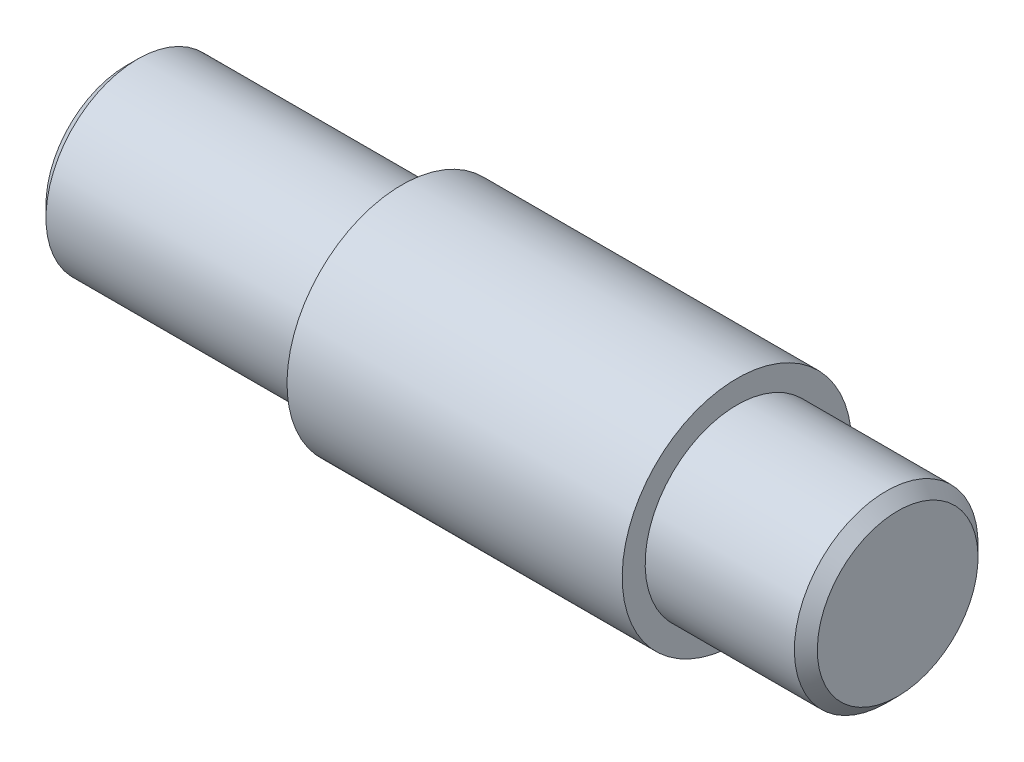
from build123d import *

# Parameters (mm, degrees)
ESQUISSE2_R             = 0.5
ENL_V_MAT_EXTRU_1_DEPTH = 1
CHANFREIN1_SIZE         = 0.25


with BuildPart() as part:
    # Esquisse1 → R_volution1 (revolve)
    with BuildSketch(Plane.XY, mode=Mode.PRIVATE) as r_volution1_sk:
        Polygon((0, 0), (16.8, 0), (16.8, 2), (13.3, 2), (13.3, 2.5), (6, 2.5), (6, 2), (0, 2), align=None)
    revolve(r_volution1_sk.sketch.rotate(Axis((0, 0, 0), (1, 0, 0)), 180), axis=Axis((0, 0, 0), (1, 0, 0)))

    # Esquisse2 → Enl_v. mat.-Extru.1 (cut)
    with BuildSketch(Plane.ZY):
        Circle(ESQUISSE2_R)
    extrude(amount=-ENL_V_MAT_EXTRU_1_DEPTH, mode=Mode.SUBTRACT)

    # Chanfrein1
    chanfrein1_edges = [part.edges().sort_by_distance(p)[0] for p in [
        (0, 2, 0),
        (16.8, 2, 0),
    ]]
    chamfer(chanfrein1_edges, length=CHANFREIN1_SIZE)


solid = part.part
